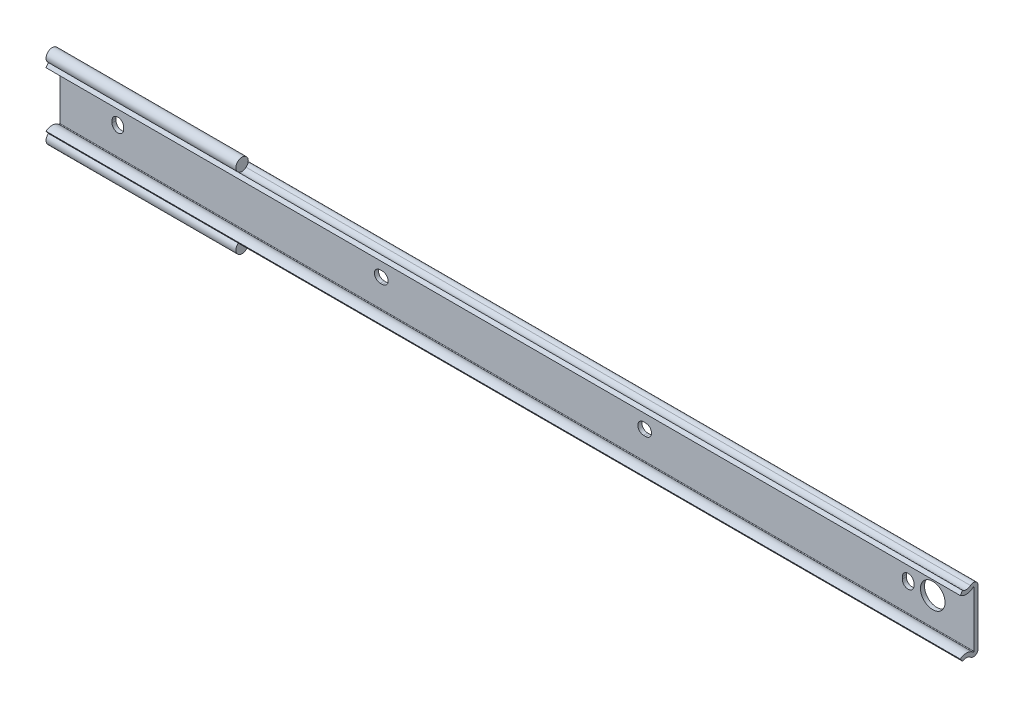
ISO-10303-21;
HEADER;
FILE_DESCRIPTION(('STEP AP214'),'2;1');
FILE_NAME('part.step','',(''),(''),'','','');
FILE_SCHEMA(('AUTOMOTIVE_DESIGN { 1 0 10303 214 1 1 1 1 }'));
ENDSEC;
DATA;
#1=APPLICATION_CONTEXT('core data for automotive mechanical design processes');
#2=APPLICATION_PROTOCOL_DEFINITION('international standard','automotive_design',2000,#1);
#3=PRODUCT_CONTEXT('',#1,'mechanical');
#4=PRODUCT('Part','Part','',(#3));
#5=PRODUCT_RELATED_PRODUCT_CATEGORY('part','',(#4));
#6=PRODUCT_DEFINITION_FORMATION('','',#4);
#7=PRODUCT_DEFINITION_CONTEXT('part definition',#1,'design');
#8=PRODUCT_DEFINITION('design','',#6,#7);
#9=PRODUCT_DEFINITION_SHAPE('','',#8);
#10=(LENGTH_UNIT() NAMED_UNIT(*) SI_UNIT(.MILLI.,.METRE.));
#11=(NAMED_UNIT(*) PLANE_ANGLE_UNIT() SI_UNIT($,.RADIAN.));
#12=(NAMED_UNIT(*) SI_UNIT($,.STERADIAN.) SOLID_ANGLE_UNIT());
#13=UNCERTAINTY_MEASURE_WITH_UNIT(LENGTH_MEASURE(1.E-05),#10,'distance_accuracy_value','');
#14=(GEOMETRIC_REPRESENTATION_CONTEXT(3) GLOBAL_UNCERTAINTY_ASSIGNED_CONTEXT((#13)) GLOBAL_UNIT_ASSIGNED_CONTEXT((#10,
#11,#12)) REPRESENTATION_CONTEXT('',''));
#15=CARTESIAN_POINT('',(0.,0.,0.));
#16=DIRECTION('',(0.,0.,1.));
#17=DIRECTION('',(1.,0.,0.));
#18=AXIS2_PLACEMENT_3D('',#15,#16,#17);
#19=CARTESIAN_POINT('',(330.2,10.6847650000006,1.74000019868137));
#20=DIRECTION('',(-1.,0.,0.));
#21=DIRECTION('',(0.,0.,1.));
#22=AXIS2_PLACEMENT_3D('',#19,#20,#21);
#23=CYLINDRICAL_SURFACE('',#22,1.7400001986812);
#24=CARTESIAN_POINT('',(-22.4,10.6847650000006,1.74000019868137));
#25=DIRECTION('',(1.,0.,0.));
#26=DIRECTION('',(0.,0.,-1.));
#27=AXIS2_PLACEMENT_3D('',#24,#25,#26);
#28=CIRCLE('',#27,1.7400001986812);
#29=CARTESIAN_POINT('',(-22.4,12.421670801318,1.84372545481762));
#30=VERTEX_POINT('',#29);
#31=CARTESIAN_POINT('',(-22.4,12.1726708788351,2.64207380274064));
#32=VERTEX_POINT('',#31);
#33=EDGE_CURVE('E251',#30,#32,#28,.T.);
#34=ORIENTED_EDGE('',*,*,#33,.T.);
#35=DIRECTION('',(-1.,0.,0.));
#36=VECTOR('',#35,1.);
#37=CARTESIAN_POINT('',(14.2,12.1726708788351,2.64207380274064));
#38=LINE('',#37,#36);
#39=CARTESIAN_POINT('',(50.8,12.1726708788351,2.64207380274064));
#40=VERTEX_POINT('',#39);
#41=EDGE_CURVE('E468',#32,#40,#38,.F.);
#42=ORIENTED_EDGE('',*,*,#41,.T.);
#43=CARTESIAN_POINT('',(50.8,10.6847650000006,1.74000019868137));
#44=DIRECTION('',(-1.,0.,0.));
#45=DIRECTION('',(0.,0.,1.));
#46=AXIS2_PLACEMENT_3D('',#43,#44,#45);
#47=CIRCLE('',#46,1.7400001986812);
#48=CARTESIAN_POINT('',(50.8,11.9768810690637,2.90534853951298));
#49=VERTEX_POINT('',#48);
#50=EDGE_CURVE('E464',#49,#40,#47,.T.);
#51=ORIENTED_EDGE('',*,*,#50,.F.);
#52=DIRECTION('',(-1.,0.,0.));
#53=VECTOR('',#52,1.);
#54=CARTESIAN_POINT('',(330.2,11.9768810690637,2.90534853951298));
#55=LINE('',#54,#53);
#56=CARTESIAN_POINT('',(330.2,11.9768810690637,2.90534853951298));
#57=VERTEX_POINT('',#56);
#58=EDGE_CURVE('E341',#57,#49,#55,.T.);
#59=ORIENTED_EDGE('',*,*,#58,.F.);
#60=CARTESIAN_POINT('',(330.2,10.6847650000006,1.74000019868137));
#61=DIRECTION('',(1.,0.,0.));
#62=DIRECTION('',(0.,0.,-1.));
#63=AXIS2_PLACEMENT_3D('',#60,#61,#62);
#64=CIRCLE('',#63,1.7400001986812);
#65=CARTESIAN_POINT('',(330.2,12.421670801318,1.84372545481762));
#66=VERTEX_POINT('',#65);
#67=EDGE_CURVE('E248',#66,#57,#64,.T.);
#68=ORIENTED_EDGE('',*,*,#67,.F.);
#69=CARTESIAN_POINT('',(330.2,10.6847650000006,1.74000019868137));
#70=DIRECTION('',(-1.,0.,0.));
#71=DIRECTION('',(0.,0.998221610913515,0.0596122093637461));
#72=AXIS2_PLACEMENT_3D('',#69,#70,#71);
#73=CIRCLE('',#72,1.7400001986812);
#74=CARTESIAN_POINT('',(330.2,12.421670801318,1.63627494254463));
#75=VERTEX_POINT('',#74);
#76=EDGE_CURVE('E239',#66,#75,#73,.T.);
#77=ORIENTED_EDGE('',*,*,#76,.T.);
#78=CARTESIAN_POINT('',(330.2,10.6847650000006,0.));
#79=VERTEX_POINT('',#78);
#80=EDGE_CURVE('E236',#79,#75,#64,.T.);
#81=ORIENTED_EDGE('',*,*,#80,.F.);
#82=DIRECTION('',(-1.,0.,0.));
#83=VECTOR('',#82,1.);
#84=CARTESIAN_POINT('',(330.2,10.6847650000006,0.));
#85=LINE('',#84,#83);
#86=CARTESIAN_POINT('',(-22.4,10.6847650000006,0.));
#87=VERTEX_POINT('',#86);
#88=EDGE_CURVE('E373',#79,#87,#85,.T.);
#89=ORIENTED_EDGE('',*,*,#88,.T.);
#90=CARTESIAN_POINT('',(-22.4,12.421670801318,1.63627494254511));
#91=VERTEX_POINT('',#90);
#92=EDGE_CURVE('E268',#87,#91,#28,.T.);
#93=ORIENTED_EDGE('',*,*,#92,.T.);
#94=CARTESIAN_POINT('',(-22.4,10.6847650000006,1.74000019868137));
#95=DIRECTION('',(1.,0.,0.));
#96=DIRECTION('',(0.,0.998221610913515,-0.0596122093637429));
#97=AXIS2_PLACEMENT_3D('',#94,#95,#96);
#98=CIRCLE('',#97,1.7400001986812);
#99=EDGE_CURVE('E265',#91,#30,#98,.T.);
#100=ORIENTED_EDGE('',*,*,#99,.T.);
#101=EDGE_LOOP('',(#34,#42,#51,#59,#68,#77,#81,#89,#93,#100));
#102=FACE_BOUND('',#101,.T.);
#103=ADVANCED_FACE('F14',(#102),#23,.T.);
#104=CARTESIAN_POINT('',(330.2,10.6847650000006,1.74000019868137));
#105=DIRECTION('',(1.,0.,0.));
#106=DIRECTION('',(0.,0.,-1.));
#107=AXIS2_PLACEMENT_3D('',#104,#105,#106);
#108=PLANE('',#107);
#109=DIRECTION('',(0.,1.,0.));
#110=VECTOR('',#109,1.);
#111=CARTESIAN_POINT('',(330.2,-10.6847650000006,0.));
#112=LINE('',#111,#110);
#113=CARTESIAN_POINT('',(330.2,-10.6847650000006,0.));
#114=VERTEX_POINT('',#113);
#115=EDGE_CURVE('E243',#114,#79,#112,.T.);
#116=ORIENTED_EDGE('',*,*,#115,.T.);
#117=ORIENTED_EDGE('',*,*,#80,.T.);
#118=ORIENTED_EDGE('',*,*,#76,.F.);
#119=ORIENTED_EDGE('',*,*,#67,.T.);
#120=CARTESIAN_POINT('',(330.2,13.7450000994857,4.50000028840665));
#121=DIRECTION('',(-1.,0.,0.));
#122=DIRECTION('',(0.,0.,-1.));
#123=AXIS2_PLACEMENT_3D('',#120,#121,#122);
#124=CIRCLE('',#123,2.38099960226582);
#125=CARTESIAN_POINT('',(330.2,11.8434490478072,5.93292132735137));
#126=VERTEX_POINT('',#125);
#127=EDGE_CURVE('E247',#57,#126,#124,.T.);
#128=ORIENTED_EDGE('',*,*,#127,.T.);
#129=DIRECTION('',(0.,-0.798635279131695,0.601815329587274));
#130=VECTOR('',#129,1.);
#131=CARTESIAN_POINT('',(330.2,10.6055642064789,6.86573520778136));
#132=LINE('',#131,#130);
#133=CARTESIAN_POINT('',(330.2,10.6055642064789,6.86573520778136));
#134=VERTEX_POINT('',#133);
#135=EDGE_CURVE('E391',#126,#134,#132,.T.);
#136=ORIENTED_EDGE('',*,*,#135,.T.);
#137=CARTESIAN_POINT('',(330.2,13.7450000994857,4.50000028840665));
#138=DIRECTION('',(1.,0.,0.));
#139=DIRECTION('',(0.,0.,-1.));
#140=AXIS2_PLACEMENT_3D('',#137,#138,#139);
#141=CIRCLE('',#140,3.9309998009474);
#142=CARTESIAN_POINT('',(330.2,10.8258581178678,1.86725086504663));
#143=VERTEX_POINT('',#142);
#144=EDGE_CURVE('E390',#134,#143,#141,.T.);
#145=ORIENTED_EDGE('',*,*,#144,.T.);
#146=CARTESIAN_POINT('',(330.2,10.6847650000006,1.74000019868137));
#147=DIRECTION('',(-1.,0.,0.));
#148=DIRECTION('',(0.,0.,-1.));
#149=AXIS2_PLACEMENT_3D('',#146,#147,#148);
#150=CIRCLE('',#149,0.18999999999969);
#151=CARTESIAN_POINT('',(330.2,10.6847650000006,1.55000019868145));
#152=VERTEX_POINT('',#151);
#153=EDGE_CURVE('E388',#143,#152,#150,.T.);
#154=ORIENTED_EDGE('',*,*,#153,.T.);
#155=DIRECTION('',(0.,-1.,0.));
#156=VECTOR('',#155,1.);
#157=CARTESIAN_POINT('',(330.2,-10.6847650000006,1.55000019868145));
#158=LINE('',#157,#156);
#159=CARTESIAN_POINT('',(330.2,-10.6847650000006,1.55000019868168));
#160=VERTEX_POINT('',#159);
#161=EDGE_CURVE('E386',#152,#160,#158,.T.);
#162=ORIENTED_EDGE('',*,*,#161,.T.);
#163=CARTESIAN_POINT('',(330.2,-10.6847650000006,1.74000019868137));
#164=DIRECTION('',(-1.,0.,0.));
#165=DIRECTION('',(0.,0.,1.));
#166=AXIS2_PLACEMENT_3D('',#163,#164,#165);
#167=CIRCLE('',#166,0.18999999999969);
#168=CARTESIAN_POINT('',(330.2,-10.8258581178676,1.86725086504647));
#169=VERTEX_POINT('',#168);
#170=EDGE_CURVE('E384',#160,#169,#167,.T.);
#171=ORIENTED_EDGE('',*,*,#170,.T.);
#172=CARTESIAN_POINT('',(330.2,-13.7450000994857,4.50000028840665));
#173=DIRECTION('',(1.,0.,0.));
#174=DIRECTION('',(0.,0.,1.));
#175=AXIS2_PLACEMENT_3D('',#172,#173,#174);
#176=CIRCLE('',#175,3.9309998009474);
#177=CARTESIAN_POINT('',(330.2,-10.6055642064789,6.86573520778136));
#178=VERTEX_POINT('',#177);
#179=EDGE_CURVE('E382',#169,#178,#176,.T.);
#180=ORIENTED_EDGE('',*,*,#179,.T.);
#181=DIRECTION('',(0.,-0.798635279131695,-0.601815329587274));
#182=VECTOR('',#181,1.);
#183=CARTESIAN_POINT('',(330.2,-10.6055642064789,6.86573520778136));
#184=LINE('',#183,#182);
#185=CARTESIAN_POINT('',(330.2,-11.8434490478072,5.93292132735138));
#186=VERTEX_POINT('',#185);
#187=EDGE_CURVE('E380',#178,#186,#184,.T.);
#188=ORIENTED_EDGE('',*,*,#187,.T.);
#189=CARTESIAN_POINT('',(330.2,-13.7450000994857,4.50000028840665));
#190=DIRECTION('',(-1.,0.,0.));
#191=DIRECTION('',(0.,0.,1.));
#192=AXIS2_PLACEMENT_3D('',#189,#190,#191);
#193=CIRCLE('',#192,2.38099960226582);
#194=CARTESIAN_POINT('',(330.2,-11.9768810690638,2.90534853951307));
#195=VERTEX_POINT('',#194);
#196=EDGE_CURVE('E378',#186,#195,#193,.T.);
#197=ORIENTED_EDGE('',*,*,#196,.T.);
#198=CARTESIAN_POINT('',(330.2,-10.6847650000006,1.74000019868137));
#199=DIRECTION('',(1.,0.,0.));
#200=DIRECTION('',(0.,0.,1.));
#201=AXIS2_PLACEMENT_3D('',#198,#199,#200);
#202=CIRCLE('',#201,1.7400001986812);
#203=EDGE_CURVE('E376',#195,#114,#202,.T.);
#204=ORIENTED_EDGE('',*,*,#203,.T.);
#205=EDGE_LOOP('',(#116,#117,#118,#119,#128,#136,#145,#154,#162,#171,#180,#188,#197,#204));
#206=FACE_BOUND('',#205,.T.);
#207=ADVANCED_FACE('F238',(#206),#108,.T.);
#208=CARTESIAN_POINT('',(-22.4,10.6847650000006,1.74000019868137));
#209=DIRECTION('',(1.,0.,0.));
#210=DIRECTION('',(0.,0.,-1.));
#211=AXIS2_PLACEMENT_3D('',#208,#209,#210);
#212=PLANE('',#211);
#213=CARTESIAN_POINT('',(-22.4,13.745,4.45));
#214=DIRECTION('',(-1.,0.,0.));
#215=DIRECTION('',(0.,0.,1.));
#216=AXIS2_PLACEMENT_3D('',#213,#214,#215);
#217=CIRCLE('',#216,2.396);
#218=CARTESIAN_POINT('',(-22.4,11.4666473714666,5.19156948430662));
#219=VERTEX_POINT('',#218);
#220=EDGE_CURVE('E460',#219,#32,#217,.T.);
#221=ORIENTED_EDGE('',*,*,#220,.T.);
#222=ORIENTED_EDGE('',*,*,#33,.F.);
#223=ORIENTED_EDGE('',*,*,#99,.F.);
#224=ORIENTED_EDGE('',*,*,#92,.F.);
#225=DIRECTION('',(0.,1.,0.));
#226=VECTOR('',#225,1.);
#227=CARTESIAN_POINT('',(-22.4,-10.6847650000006,0.));
#228=LINE('',#227,#226);
#229=CARTESIAN_POINT('',(-22.4,-10.6847650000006,0.));
#230=VERTEX_POINT('',#229);
#231=EDGE_CURVE('E294',#230,#87,#228,.T.);
#232=ORIENTED_EDGE('',*,*,#231,.F.);
#233=CARTESIAN_POINT('',(-22.4,-10.6847650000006,1.74000019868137));
#234=DIRECTION('',(1.,0.,0.));
#235=DIRECTION('',(0.,0.,1.));
#236=AXIS2_PLACEMENT_3D('',#233,#234,#235);
#237=CIRCLE('',#236,1.7400001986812);
#238=CARTESIAN_POINT('',(-22.4,-12.1726708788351,2.64207380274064));
#239=VERTEX_POINT('',#238);
#240=EDGE_CURVE('E292',#239,#230,#237,.T.);
#241=ORIENTED_EDGE('',*,*,#240,.F.);
#242=CARTESIAN_POINT('',(-22.4,-13.745,4.45));
#243=DIRECTION('',(-1.,0.,0.));
#244=DIRECTION('',(0.,0.,-1.));
#245=AXIS2_PLACEMENT_3D('',#242,#243,#244);
#246=CIRCLE('',#245,2.396);
#247=CARTESIAN_POINT('',(-22.4,-11.4666473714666,5.19156948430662));
#248=VERTEX_POINT('',#247);
#249=EDGE_CURVE('E442',#239,#248,#246,.T.);
#250=ORIENTED_EDGE('',*,*,#249,.T.);
#251=CARTESIAN_POINT('',(-22.4,-13.7450000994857,4.50000028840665));
#252=DIRECTION('',(-1.,0.,0.));
#253=DIRECTION('',(0.,0.,1.));
#254=AXIS2_PLACEMENT_3D('',#251,#252,#253);
#255=CIRCLE('',#254,2.38099960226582);
#256=CARTESIAN_POINT('',(-22.4,-11.8434490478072,5.93292132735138));
#257=VERTEX_POINT('',#256);
#258=EDGE_CURVE('E37',#257,#248,#255,.T.);
#259=ORIENTED_EDGE('',*,*,#258,.F.);
#260=DIRECTION('',(0.,-0.798635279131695,-0.601815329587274));
#261=VECTOR('',#260,1.);
#262=CARTESIAN_POINT('',(-22.4,-10.6055642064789,6.86573520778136));
#263=LINE('',#262,#261);
#264=CARTESIAN_POINT('',(-22.4,-10.6055642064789,6.86573520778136));
#265=VERTEX_POINT('',#264);
#266=EDGE_CURVE('E289',#265,#257,#263,.T.);
#267=ORIENTED_EDGE('',*,*,#266,.F.);
#268=CARTESIAN_POINT('',(-22.4,-13.7450000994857,4.50000028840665));
#269=DIRECTION('',(1.,0.,0.));
#270=DIRECTION('',(0.,0.,1.));
#271=AXIS2_PLACEMENT_3D('',#268,#269,#270);
#272=CIRCLE('',#271,3.9309998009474);
#273=CARTESIAN_POINT('',(-22.4,-10.8258581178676,1.86725086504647));
#274=VERTEX_POINT('',#273);
#275=EDGE_CURVE('E287',#274,#265,#272,.T.);
#276=ORIENTED_EDGE('',*,*,#275,.F.);
#277=CARTESIAN_POINT('',(-22.4,-10.6847650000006,1.74000019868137));
#278=DIRECTION('',(-1.,0.,0.));
#279=DIRECTION('',(0.,0.,1.));
#280=AXIS2_PLACEMENT_3D('',#277,#278,#279);
#281=CIRCLE('',#280,0.18999999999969);
#282=CARTESIAN_POINT('',(-22.4,-10.6847650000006,1.55000019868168));
#283=VERTEX_POINT('',#282);
#284=EDGE_CURVE('E285',#283,#274,#281,.T.);
#285=ORIENTED_EDGE('',*,*,#284,.F.);
#286=DIRECTION('',(0.,-1.,0.));
#287=VECTOR('',#286,1.);
#288=CARTESIAN_POINT('',(-22.4,-10.6847650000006,1.55000019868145));
#289=LINE('',#288,#287);
#290=CARTESIAN_POINT('',(-22.4,10.6847650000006,1.55000019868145));
#291=VERTEX_POINT('',#290);
#292=EDGE_CURVE('E283',#291,#283,#289,.T.);
#293=ORIENTED_EDGE('',*,*,#292,.F.);
#294=CARTESIAN_POINT('',(-22.4,10.6847650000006,1.74000019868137));
#295=DIRECTION('',(-1.,0.,0.));
#296=DIRECTION('',(0.,0.,-1.));
#297=AXIS2_PLACEMENT_3D('',#294,#295,#296);
#298=CIRCLE('',#297,0.18999999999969);
#299=CARTESIAN_POINT('',(-22.4,10.8258581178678,1.86725086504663));
#300=VERTEX_POINT('',#299);
#301=EDGE_CURVE('E281',#300,#291,#298,.T.);
#302=ORIENTED_EDGE('',*,*,#301,.F.);
#303=CARTESIAN_POINT('',(-22.4,13.7450000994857,4.50000028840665));
#304=DIRECTION('',(1.,0.,0.));
#305=DIRECTION('',(0.,0.,-1.));
#306=AXIS2_PLACEMENT_3D('',#303,#304,#305);
#307=CIRCLE('',#306,3.9309998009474);
#308=CARTESIAN_POINT('',(-22.4,10.6055642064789,6.86573520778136));
#309=VERTEX_POINT('',#308);
#310=EDGE_CURVE('E279',#309,#300,#307,.T.);
#311=ORIENTED_EDGE('',*,*,#310,.F.);
#312=DIRECTION('',(0.,-0.798635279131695,0.601815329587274));
#313=VECTOR('',#312,1.);
#314=CARTESIAN_POINT('',(-22.4,10.6055642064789,6.86573520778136));
#315=LINE('',#314,#313);
#316=CARTESIAN_POINT('',(-22.4,11.8434490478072,5.93292132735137));
#317=VERTEX_POINT('',#316);
#318=EDGE_CURVE('E277',#317,#309,#315,.T.);
#319=ORIENTED_EDGE('',*,*,#318,.F.);
#320=CARTESIAN_POINT('',(-22.4,13.7450000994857,4.50000028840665));
#321=DIRECTION('',(-1.,0.,0.));
#322=DIRECTION('',(0.,0.,-1.));
#323=AXIS2_PLACEMENT_3D('',#320,#321,#322);
#324=CIRCLE('',#323,2.38099960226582);
#325=EDGE_CURVE('E274',#219,#317,#324,.T.);
#326=ORIENTED_EDGE('',*,*,#325,.F.);
#327=EDGE_LOOP('',(#221,#222,#223,#224,#232,#241,#250,#259,#267,#276,#285,#293,#302,#311,#319,#326));
#328=FACE_BOUND('',#327,.T.);
#329=ADVANCED_FACE('F308',(#328),#212,.F.);
#330=CARTESIAN_POINT('',(330.2,13.7450000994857,4.50000028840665));
#331=DIRECTION('',(-1.,0.,0.));
#332=DIRECTION('',(0.,0.,1.));
#333=AXIS2_PLACEMENT_3D('',#330,#331,#332);
#334=CYLINDRICAL_SURFACE('',#333,2.38099960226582);
#335=CARTESIAN_POINT('',(50.8,13.7450000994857,4.50000028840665));
#336=DIRECTION('',(-1.,0.,0.));
#337=DIRECTION('',(0.,0.,1.));
#338=AXIS2_PLACEMENT_3D('',#335,#336,#337);
#339=CIRCLE('',#338,2.38099960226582);
#340=CARTESIAN_POINT('',(50.8,11.4666473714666,5.19156948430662));
#341=VERTEX_POINT('',#340);
#342=EDGE_CURVE('E338',#341,#49,#339,.F.);
#343=ORIENTED_EDGE('',*,*,#342,.F.);
#344=DIRECTION('',(-1.,0.,0.));
#345=VECTOR('',#344,1.);
#346=CARTESIAN_POINT('',(14.2,11.4666473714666,5.19156948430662));
#347=LINE('',#346,#345);
#348=EDGE_CURVE('E335',#341,#219,#347,.T.);
#349=ORIENTED_EDGE('',*,*,#348,.T.);
#350=ORIENTED_EDGE('',*,*,#325,.T.);
#351=DIRECTION('',(-1.,0.,0.));
#352=VECTOR('',#351,1.);
#353=CARTESIAN_POINT('',(330.2,11.8434490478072,5.93292132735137));
#354=LINE('',#353,#352);
#355=EDGE_CURVE('E344',#126,#317,#354,.T.);
#356=ORIENTED_EDGE('',*,*,#355,.F.);
#357=ORIENTED_EDGE('',*,*,#127,.F.);
#358=ORIENTED_EDGE('',*,*,#58,.T.);
#359=EDGE_LOOP('',(#343,#349,#350,#356,#357,#358));
#360=FACE_BOUND('',#359,.T.);
#361=ADVANCED_FACE('F318',(#360),#334,.F.);
#362=CARTESIAN_POINT('',(330.2,10.6055642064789,6.86573520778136));
#363=DIRECTION('',(0.,-0.601815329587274,-0.798635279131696));
#364=DIRECTION('',(0.,0.798635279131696,-0.601815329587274));
#365=AXIS2_PLACEMENT_3D('',#362,#363,#364);
#366=PLANE('',#365);
#367=ORIENTED_EDGE('',*,*,#318,.T.);
#368=DIRECTION('',(-1.,0.,0.));
#369=VECTOR('',#368,1.);
#370=CARTESIAN_POINT('',(330.2,10.6055642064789,6.86573520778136));
#371=LINE('',#370,#369);
#372=EDGE_CURVE('E347',#134,#309,#371,.T.);
#373=ORIENTED_EDGE('',*,*,#372,.F.);
#374=ORIENTED_EDGE('',*,*,#135,.F.);
#375=ORIENTED_EDGE('',*,*,#355,.T.);
#376=EDGE_LOOP('',(#367,#373,#374,#375));
#377=FACE_BOUND('',#376,.T.);
#378=ADVANCED_FACE('F399',(#377),#366,.F.);
#379=CARTESIAN_POINT('',(330.2,13.7450000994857,4.50000028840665));
#380=DIRECTION('',(-1.,0.,0.));
#381=DIRECTION('',(0.,0.,1.));
#382=AXIS2_PLACEMENT_3D('',#379,#380,#381);
#383=CYLINDRICAL_SURFACE('',#382,3.9309998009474);
#384=ORIENTED_EDGE('',*,*,#310,.T.);
#385=DIRECTION('',(-1.,0.,0.));
#386=VECTOR('',#385,1.);
#387=CARTESIAN_POINT('',(330.2,10.8258581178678,1.86725086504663));
#388=LINE('',#387,#386);
#389=EDGE_CURVE('E350',#143,#300,#388,.T.);
#390=ORIENTED_EDGE('',*,*,#389,.F.);
#391=ORIENTED_EDGE('',*,*,#144,.F.);
#392=ORIENTED_EDGE('',*,*,#372,.T.);
#393=EDGE_LOOP('',(#384,#390,#391,#392));
#394=FACE_BOUND('',#393,.T.);
#395=ADVANCED_FACE('F404',(#394),#383,.T.);
#396=CARTESIAN_POINT('',(330.2,10.6847650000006,1.74000019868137));
#397=DIRECTION('',(-1.,0.,0.));
#398=DIRECTION('',(0.,0.,1.));
#399=AXIS2_PLACEMENT_3D('',#396,#397,#398);
#400=CYLINDRICAL_SURFACE('',#399,0.18999999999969);
#401=ORIENTED_EDGE('',*,*,#301,.T.);
#402=DIRECTION('',(-1.,0.,0.));
#403=VECTOR('',#402,1.);
#404=CARTESIAN_POINT('',(330.2,10.6847650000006,1.55000019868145));
#405=LINE('',#404,#403);
#406=EDGE_CURVE('E353',#152,#291,#405,.T.);
#407=ORIENTED_EDGE('',*,*,#406,.F.);
#408=ORIENTED_EDGE('',*,*,#153,.F.);
#409=ORIENTED_EDGE('',*,*,#389,.T.);
#410=EDGE_LOOP('',(#401,#407,#408,#409));
#411=FACE_BOUND('',#410,.T.);
#412=ADVANCED_FACE('F410',(#411),#400,.F.);
#413=CARTESIAN_POINT('',(330.2,-10.6847650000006,1.55000019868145));
#414=DIRECTION('',(0.,0.,-1.));
#415=DIRECTION('',(-1.,0.,0.));
#416=AXIS2_PLACEMENT_3D('',#413,#414,#415);
#417=PLANE('',#416);
#418=CARTESIAN_POINT('',(314.3,0.,1.55000019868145));
#419=DIRECTION('',(0.,0.,-1.));
#420=DIRECTION('',(-1.,0.,0.));
#421=AXIS2_PLACEMENT_3D('',#418,#419,#420);
#422=CIRCLE('',#421,4.75);
#423=CARTESIAN_POINT('',(309.55,0.,1.55000019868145));
#424=VERTEX_POINT('',#423);
#425=EDGE_CURVE('E450',#424,#424,#422,.T.);
#426=ORIENTED_EDGE('',*,*,#425,.T.);
#427=EDGE_LOOP('',(#426));
#428=FACE_BOUND('',#427,.T.);
#429=DIRECTION('',(0.,-1.,0.));
#430=VECTOR('',#429,1.);
#431=CARTESIAN_POINT('',(-2.25,0.4,1.55000019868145));
#432=LINE('',#431,#430);
#433=CARTESIAN_POINT('',(-2.25,0.4,1.55000019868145));
#434=VERTEX_POINT('',#433);
#435=CARTESIAN_POINT('',(-2.25,-0.4,1.55000019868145));
#436=VERTEX_POINT('',#435);
#437=EDGE_CURVE('E472',#434,#436,#432,.T.);
#438=ORIENTED_EDGE('',*,*,#437,.F.);
#439=CARTESIAN_POINT('',(0.,0.4,1.55000019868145));
#440=DIRECTION('',(0.,0.,-1.));
#441=DIRECTION('',(-1.,0.,0.));
#442=AXIS2_PLACEMENT_3D('',#439,#440,#441);
#443=CIRCLE('',#442,2.24999999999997);
#444=CARTESIAN_POINT('',(2.25,0.4,1.55000019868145));
#445=VERTEX_POINT('',#444);
#446=EDGE_CURVE('E475',#445,#434,#443,.F.);
#447=ORIENTED_EDGE('',*,*,#446,.F.);
#448=DIRECTION('',(0.,1.,0.));
#449=VECTOR('',#448,1.);
#450=CARTESIAN_POINT('',(2.25,-0.4,1.55000019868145));
#451=LINE('',#450,#449);
#452=CARTESIAN_POINT('',(2.25,-0.4,1.55000019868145));
#453=VERTEX_POINT('',#452);
#454=EDGE_CURVE('E492',#453,#445,#451,.T.);
#455=ORIENTED_EDGE('',*,*,#454,.F.);
#456=CARTESIAN_POINT('',(0.,-0.4,1.55000019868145));
#457=DIRECTION('',(0.,0.,-1.));
#458=DIRECTION('',(-1.,0.,0.));
#459=AXIS2_PLACEMENT_3D('',#456,#457,#458);
#460=CIRCLE('',#459,2.24999999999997);
#461=EDGE_CURVE('E470',#436,#453,#460,.F.);
#462=ORIENTED_EDGE('',*,*,#461,.F.);
#463=EDGE_LOOP('',(#438,#447,#455,#462));
#464=FACE_BOUND('',#463,.T.);
#465=DIRECTION('',(-1.,0.,0.));
#466=VECTOR('',#465,1.);
#467=CARTESIAN_POINT('',(203.600000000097,2.25,1.55000019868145));
#468=LINE('',#467,#466);
#469=CARTESIAN_POINT('',(203.600000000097,2.25,1.55000019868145));
#470=VERTEX_POINT('',#469);
#471=CARTESIAN_POINT('',(202.800000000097,2.25,1.55000019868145));
#472=VERTEX_POINT('',#471);
#473=EDGE_CURVE('E503',#470,#472,#468,.T.);
#474=ORIENTED_EDGE('',*,*,#473,.F.);
#475=CARTESIAN_POINT('',(203.600000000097,0.,1.55000019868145));
#476=DIRECTION('',(0.,0.,-1.));
#477=DIRECTION('',(-1.,0.,0.));
#478=AXIS2_PLACEMENT_3D('',#475,#476,#477);
#479=CIRCLE('',#478,2.25);
#480=CARTESIAN_POINT('',(203.600000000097,-2.25,1.55000019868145));
#481=VERTEX_POINT('',#480);
#482=EDGE_CURVE('E506',#481,#470,#479,.F.);
#483=ORIENTED_EDGE('',*,*,#482,.F.);
#484=DIRECTION('',(1.,0.,0.));
#485=VECTOR('',#484,1.);
#486=CARTESIAN_POINT('',(202.800000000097,-2.25,1.55000019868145));
#487=LINE('',#486,#485);
#488=CARTESIAN_POINT('',(202.800000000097,-2.25,1.55000019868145));
#489=VERTEX_POINT('',#488);
#490=EDGE_CURVE('E523',#489,#481,#487,.T.);
#491=ORIENTED_EDGE('',*,*,#490,.F.);
#492=CARTESIAN_POINT('',(202.800000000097,0.,1.55000019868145));
#493=DIRECTION('',(0.,0.,-1.));
#494=DIRECTION('',(-1.,0.,0.));
#495=AXIS2_PLACEMENT_3D('',#492,#493,#494);
#496=CIRCLE('',#495,2.25);
#497=EDGE_CURVE('E501',#472,#489,#496,.F.);
#498=ORIENTED_EDGE('',*,*,#497,.F.);
#499=EDGE_LOOP('',(#474,#483,#491,#498));
#500=FACE_BOUND('',#499,.T.);
#501=DIRECTION('',(0.,-1.,0.));
#502=VECTOR('',#501,1.);
#503=CARTESIAN_POINT('',(302.55,0.4,1.55000019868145));
#504=LINE('',#503,#502);
#505=CARTESIAN_POINT('',(302.55,0.4,1.55000019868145));
#506=VERTEX_POINT('',#505);
#507=CARTESIAN_POINT('',(302.55,-0.4,1.55000019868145));
#508=VERTEX_POINT('',#507);
#509=EDGE_CURVE('E534',#506,#508,#504,.T.);
#510=ORIENTED_EDGE('',*,*,#509,.F.);
#511=CARTESIAN_POINT('',(304.8,0.4,1.55000019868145));
#512=DIRECTION('',(0.,0.,-1.));
#513=DIRECTION('',(-1.,0.,0.));
#514=AXIS2_PLACEMENT_3D('',#511,#512,#513);
#515=CIRCLE('',#514,2.24999999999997);
#516=CARTESIAN_POINT('',(307.05,0.4,1.55000019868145));
#517=VERTEX_POINT('',#516);
#518=EDGE_CURVE('E537',#517,#506,#515,.F.);
#519=ORIENTED_EDGE('',*,*,#518,.F.);
#520=DIRECTION('',(0.,1.,0.));
#521=VECTOR('',#520,1.);
#522=CARTESIAN_POINT('',(307.05,-0.4,1.55000019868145));
#523=LINE('',#522,#521);
#524=CARTESIAN_POINT('',(307.05,-0.4,1.55000019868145));
#525=VERTEX_POINT('',#524);
#526=EDGE_CURVE('E554',#525,#517,#523,.T.);
#527=ORIENTED_EDGE('',*,*,#526,.F.);
#528=CARTESIAN_POINT('',(304.8,-0.4,1.55000019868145));
#529=DIRECTION('',(0.,0.,-1.));
#530=DIRECTION('',(-1.,0.,0.));
#531=AXIS2_PLACEMENT_3D('',#528,#529,#530);
#532=CIRCLE('',#531,2.24999999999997);
#533=EDGE_CURVE('E532',#508,#525,#532,.F.);
#534=ORIENTED_EDGE('',*,*,#533,.F.);
#535=EDGE_LOOP('',(#510,#519,#527,#534));
#536=FACE_BOUND('',#535,.T.);
#537=DIRECTION('',(-1.,0.,0.));
#538=VECTOR('',#537,1.);
#539=CARTESIAN_POINT('',(101.999999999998,2.25,1.55000019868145));
#540=LINE('',#539,#538);
#541=CARTESIAN_POINT('',(101.999999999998,2.25,1.55000019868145));
#542=VERTEX_POINT('',#541);
#543=CARTESIAN_POINT('',(101.199999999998,2.25,1.55000019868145));
#544=VERTEX_POINT('',#543);
#545=EDGE_CURVE('E565',#542,#544,#540,.T.);
#546=ORIENTED_EDGE('',*,*,#545,.F.);
#547=CARTESIAN_POINT('',(101.999999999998,0.,1.55000019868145));
#548=DIRECTION('',(0.,0.,-1.));
#549=DIRECTION('',(-1.,0.,0.));
#550=AXIS2_PLACEMENT_3D('',#547,#548,#549);
#551=CIRCLE('',#550,2.25);
#552=CARTESIAN_POINT('',(101.999999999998,-2.25,1.55000019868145));
#553=VERTEX_POINT('',#552);
#554=EDGE_CURVE('E568',#553,#542,#551,.F.);
#555=ORIENTED_EDGE('',*,*,#554,.F.);
#556=DIRECTION('',(1.,0.,0.));
#557=VECTOR('',#556,1.);
#558=CARTESIAN_POINT('',(101.199999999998,-2.25,1.55000019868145));
#559=LINE('',#558,#557);
#560=CARTESIAN_POINT('',(101.199999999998,-2.25,1.55000019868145));
#561=VERTEX_POINT('',#560);
#562=EDGE_CURVE('E252',#561,#553,#559,.T.);
#563=ORIENTED_EDGE('',*,*,#562,.F.);
#564=CARTESIAN_POINT('',(101.199999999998,0.,1.55000019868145));
#565=DIRECTION('',(0.,0.,-1.));
#566=DIRECTION('',(-1.,0.,0.));
#567=AXIS2_PLACEMENT_3D('',#564,#565,#566);
#568=CIRCLE('',#567,2.25);
#569=EDGE_CURVE('E563',#544,#561,#568,.F.);
#570=ORIENTED_EDGE('',*,*,#569,.F.);
#571=EDGE_LOOP('',(#546,#555,#563,#570));
#572=FACE_BOUND('',#571,.T.);
#573=ORIENTED_EDGE('',*,*,#292,.T.);
#574=DIRECTION('',(-1.,0.,0.));
#575=VECTOR('',#574,1.);
#576=CARTESIAN_POINT('',(330.2,-10.6847650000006,1.55000019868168));
#577=LINE('',#576,#575);
#578=EDGE_CURVE('E356',#160,#283,#577,.T.);
#579=ORIENTED_EDGE('',*,*,#578,.F.);
#580=ORIENTED_EDGE('',*,*,#161,.F.);
#581=ORIENTED_EDGE('',*,*,#406,.T.);
#582=EDGE_LOOP('',(#573,#579,#580,#581));
#583=FACE_BOUND('',#582,.T.);
#584=ADVANCED_FACE('F414',(#428,#464,#500,#536,#572,#583),#417,.F.);
#585=CARTESIAN_POINT('',(330.2,-10.6847650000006,1.74000019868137));
#586=DIRECTION('',(-1.,0.,0.));
#587=DIRECTION('',(0.,0.,1.));
#588=AXIS2_PLACEMENT_3D('',#585,#586,#587);
#589=CYLINDRICAL_SURFACE('',#588,0.18999999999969);
#590=ORIENTED_EDGE('',*,*,#284,.T.);
#591=DIRECTION('',(-1.,0.,0.));
#592=VECTOR('',#591,1.);
#593=CARTESIAN_POINT('',(330.2,-10.8258581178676,1.86725086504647));
#594=LINE('',#593,#592);
#595=EDGE_CURVE('E359',#169,#274,#594,.T.);
#596=ORIENTED_EDGE('',*,*,#595,.F.);
#597=ORIENTED_EDGE('',*,*,#170,.F.);
#598=ORIENTED_EDGE('',*,*,#578,.T.);
#599=EDGE_LOOP('',(#590,#596,#597,#598));
#600=FACE_BOUND('',#599,.T.);
#601=ADVANCED_FACE('F419',(#600),#589,.F.);
#602=CARTESIAN_POINT('',(330.2,-13.7450000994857,4.50000028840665));
#603=DIRECTION('',(-1.,0.,0.));
#604=DIRECTION('',(0.,0.,1.));
#605=AXIS2_PLACEMENT_3D('',#602,#603,#604);
#606=CYLINDRICAL_SURFACE('',#605,3.9309998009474);
#607=ORIENTED_EDGE('',*,*,#275,.T.);
#608=DIRECTION('',(-1.,0.,0.));
#609=VECTOR('',#608,1.);
#610=CARTESIAN_POINT('',(330.2,-10.6055642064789,6.86573520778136));
#611=LINE('',#610,#609);
#612=EDGE_CURVE('E362',#178,#265,#611,.T.);
#613=ORIENTED_EDGE('',*,*,#612,.F.);
#614=ORIENTED_EDGE('',*,*,#179,.F.);
#615=ORIENTED_EDGE('',*,*,#595,.T.);
#616=EDGE_LOOP('',(#607,#613,#614,#615));
#617=FACE_BOUND('',#616,.T.);
#618=ADVANCED_FACE('F425',(#617),#606,.T.);
#619=CARTESIAN_POINT('',(330.2,-10.6055642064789,6.86573520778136));
#620=DIRECTION('',(0.,0.601815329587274,-0.798635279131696));
#621=DIRECTION('',(0.,0.798635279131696,0.601815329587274));
#622=AXIS2_PLACEMENT_3D('',#619,#620,#621);
#623=PLANE('',#622);
#624=ORIENTED_EDGE('',*,*,#266,.T.);
#625=DIRECTION('',(-1.,0.,0.));
#626=VECTOR('',#625,1.);
#627=CARTESIAN_POINT('',(330.2,-11.8434490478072,5.93292132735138));
#628=LINE('',#627,#626);
#629=EDGE_CURVE('E365',#186,#257,#628,.T.);
#630=ORIENTED_EDGE('',*,*,#629,.F.);
#631=ORIENTED_EDGE('',*,*,#187,.F.);
#632=ORIENTED_EDGE('',*,*,#612,.T.);
#633=EDGE_LOOP('',(#624,#630,#631,#632));
#634=FACE_BOUND('',#633,.T.);
#635=ADVANCED_FACE('F429',(#634),#623,.F.);
#636=CARTESIAN_POINT('',(330.2,-13.7450000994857,4.50000028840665));
#637=DIRECTION('',(-1.,0.,0.));
#638=DIRECTION('',(0.,0.,1.));
#639=AXIS2_PLACEMENT_3D('',#636,#637,#638);
#640=CYLINDRICAL_SURFACE('',#639,2.38099960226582);
#641=ORIENTED_EDGE('',*,*,#258,.T.);
#642=DIRECTION('',(-1.,0.,0.));
#643=VECTOR('',#642,1.);
#644=CARTESIAN_POINT('',(14.2,-11.4666473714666,5.19156948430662));
#645=LINE('',#644,#643);
#646=CARTESIAN_POINT('',(50.8,-11.4666473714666,5.19156948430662));
#647=VERTEX_POINT('',#646);
#648=EDGE_CURVE('E32',#248,#647,#645,.F.);
#649=ORIENTED_EDGE('',*,*,#648,.T.);
#650=CARTESIAN_POINT('',(50.8,-13.7450000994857,4.50000028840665));
#651=DIRECTION('',(1.,0.,0.));
#652=DIRECTION('',(0.,0.,-1.));
#653=AXIS2_PLACEMENT_3D('',#650,#651,#652);
#654=CIRCLE('',#653,2.38099960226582);
#655=CARTESIAN_POINT('',(50.8,-11.9768810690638,2.90534853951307));
#656=VERTEX_POINT('',#655);
#657=EDGE_CURVE('E452',#647,#656,#654,.F.);
#658=ORIENTED_EDGE('',*,*,#657,.T.);
#659=DIRECTION('',(-1.,0.,0.));
#660=VECTOR('',#659,1.);
#661=CARTESIAN_POINT('',(330.2,-11.9768810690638,2.90534853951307));
#662=LINE('',#661,#660);
#663=EDGE_CURVE('E367',#195,#656,#662,.T.);
#664=ORIENTED_EDGE('',*,*,#663,.F.);
#665=ORIENTED_EDGE('',*,*,#196,.F.);
#666=ORIENTED_EDGE('',*,*,#629,.T.);
#667=EDGE_LOOP('',(#641,#649,#658,#664,#665,#666));
#668=FACE_BOUND('',#667,.T.);
#669=ADVANCED_FACE('F432',(#668),#640,.F.);
#670=CARTESIAN_POINT('',(330.2,-10.6847650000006,1.74000019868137));
#671=DIRECTION('',(-1.,0.,0.));
#672=DIRECTION('',(0.,0.,1.));
#673=AXIS2_PLACEMENT_3D('',#670,#671,#672);
#674=CYLINDRICAL_SURFACE('',#673,1.7400001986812);
#675=CARTESIAN_POINT('',(50.8,-10.6847650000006,1.74000019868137));
#676=DIRECTION('',(1.,0.,0.));
#677=DIRECTION('',(0.,0.,-1.));
#678=AXIS2_PLACEMENT_3D('',#675,#676,#677);
#679=CIRCLE('',#678,1.7400001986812);
#680=CARTESIAN_POINT('',(50.8,-12.1726708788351,2.64207380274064));
#681=VERTEX_POINT('',#680);
#682=EDGE_CURVE('E24',#656,#681,#679,.T.);
#683=ORIENTED_EDGE('',*,*,#682,.T.);
#684=DIRECTION('',(-1.,0.,0.));
#685=VECTOR('',#684,1.);
#686=CARTESIAN_POINT('',(14.2,-12.1726708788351,2.64207380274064));
#687=LINE('',#686,#685);
#688=EDGE_CURVE('E9',#681,#239,#687,.T.);
#689=ORIENTED_EDGE('',*,*,#688,.T.);
#690=ORIENTED_EDGE('',*,*,#240,.T.);
#691=DIRECTION('',(-1.,0.,0.));
#692=VECTOR('',#691,1.);
#693=CARTESIAN_POINT('',(330.2,-10.6847650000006,0.));
#694=LINE('',#693,#692);
#695=EDGE_CURVE('E370',#114,#230,#694,.T.);
#696=ORIENTED_EDGE('',*,*,#695,.F.);
#697=ORIENTED_EDGE('',*,*,#203,.F.);
#698=ORIENTED_EDGE('',*,*,#663,.T.);
#699=EDGE_LOOP('',(#683,#689,#690,#696,#697,#698));
#700=FACE_BOUND('',#699,.T.);
#701=ADVANCED_FACE('F436',(#700),#674,.T.);
#702=CARTESIAN_POINT('',(330.2,-10.6847650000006,0.));
#703=DIRECTION('',(0.,0.,1.));
#704=DIRECTION('',(1.,0.,0.));
#705=AXIS2_PLACEMENT_3D('',#702,#703,#704);
#706=PLANE('',#705);
#707=CARTESIAN_POINT('',(314.3,0.,0.));
#708=DIRECTION('',(0.,0.,-1.));
#709=DIRECTION('',(-1.,0.,0.));
#710=AXIS2_PLACEMENT_3D('',#707,#708,#709);
#711=CIRCLE('',#710,4.75);
#712=CARTESIAN_POINT('',(309.55,0.,0.));
#713=VERTEX_POINT('',#712);
#714=EDGE_CURVE('E455',#713,#713,#711,.T.);
#715=ORIENTED_EDGE('',*,*,#714,.F.);
#716=EDGE_LOOP('',(#715));
#717=FACE_BOUND('',#716,.T.);
#718=DIRECTION('',(0.,-1.,0.));
#719=VECTOR('',#718,1.);
#720=CARTESIAN_POINT('',(2.25,-0.4,0.));
#721=LINE('',#720,#719);
#722=CARTESIAN_POINT('',(2.25,0.4,0.));
#723=VERTEX_POINT('',#722);
#724=CARTESIAN_POINT('',(2.25,-0.4,0.));
#725=VERTEX_POINT('',#724);
#726=EDGE_CURVE('E480',#723,#725,#721,.T.);
#727=ORIENTED_EDGE('',*,*,#726,.F.);
#728=CARTESIAN_POINT('',(0.,0.4,0.));
#729=DIRECTION('',(0.,0.,-1.));
#730=DIRECTION('',(-1.,0.,0.));
#731=AXIS2_PLACEMENT_3D('',#728,#729,#730);
#732=CIRCLE('',#731,2.24999999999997);
#733=CARTESIAN_POINT('',(-2.25,0.4,0.));
#734=VERTEX_POINT('',#733);
#735=EDGE_CURVE('E478',#734,#723,#732,.T.);
#736=ORIENTED_EDGE('',*,*,#735,.F.);
#737=DIRECTION('',(0.,1.,0.));
#738=VECTOR('',#737,1.);
#739=CARTESIAN_POINT('',(-2.25,0.4,0.));
#740=LINE('',#739,#738);
#741=CARTESIAN_POINT('',(-2.25,-0.4,0.));
#742=VERTEX_POINT('',#741);
#743=EDGE_CURVE('E486',#742,#734,#740,.T.);
#744=ORIENTED_EDGE('',*,*,#743,.F.);
#745=CARTESIAN_POINT('',(0.,-0.4,0.));
#746=DIRECTION('',(0.,0.,-1.));
#747=DIRECTION('',(-1.,0.,0.));
#748=AXIS2_PLACEMENT_3D('',#745,#746,#747);
#749=CIRCLE('',#748,2.24999999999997);
#750=EDGE_CURVE('E483',#725,#742,#749,.T.);
#751=ORIENTED_EDGE('',*,*,#750,.F.);
#752=EDGE_LOOP('',(#727,#736,#744,#751));
#753=FACE_BOUND('',#752,.T.);
#754=DIRECTION('',(-1.,0.,0.));
#755=VECTOR('',#754,1.);
#756=CARTESIAN_POINT('',(202.800000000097,-2.25,0.));
#757=LINE('',#756,#755);
#758=CARTESIAN_POINT('',(203.600000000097,-2.25,0.));
#759=VERTEX_POINT('',#758);
#760=CARTESIAN_POINT('',(202.800000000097,-2.25,0.));
#761=VERTEX_POINT('',#760);
#762=EDGE_CURVE('E511',#759,#761,#757,.T.);
#763=ORIENTED_EDGE('',*,*,#762,.F.);
#764=CARTESIAN_POINT('',(203.600000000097,0.,0.));
#765=DIRECTION('',(0.,0.,-1.));
#766=DIRECTION('',(-1.,0.,0.));
#767=AXIS2_PLACEMENT_3D('',#764,#765,#766);
#768=CIRCLE('',#767,2.25);
#769=CARTESIAN_POINT('',(203.600000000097,2.25,0.));
#770=VERTEX_POINT('',#769);
#771=EDGE_CURVE('E509',#770,#759,#768,.T.);
#772=ORIENTED_EDGE('',*,*,#771,.F.);
#773=DIRECTION('',(1.,0.,0.));
#774=VECTOR('',#773,1.);
#775=CARTESIAN_POINT('',(203.600000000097,2.25,0.));
#776=LINE('',#775,#774);
#777=CARTESIAN_POINT('',(202.800000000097,2.25,0.));
#778=VERTEX_POINT('',#777);
#779=EDGE_CURVE('E517',#778,#770,#776,.T.);
#780=ORIENTED_EDGE('',*,*,#779,.F.);
#781=CARTESIAN_POINT('',(202.800000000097,0.,0.));
#782=DIRECTION('',(0.,0.,-1.));
#783=DIRECTION('',(-1.,0.,0.));
#784=AXIS2_PLACEMENT_3D('',#781,#782,#783);
#785=CIRCLE('',#784,2.25);
#786=EDGE_CURVE('E514',#761,#778,#785,.T.);
#787=ORIENTED_EDGE('',*,*,#786,.F.);
#788=EDGE_LOOP('',(#763,#772,#780,#787));
#789=FACE_BOUND('',#788,.T.);
#790=DIRECTION('',(0.,-1.,0.));
#791=VECTOR('',#790,1.);
#792=CARTESIAN_POINT('',(307.05,-0.4,0.));
#793=LINE('',#792,#791);
#794=CARTESIAN_POINT('',(307.05,0.4,0.));
#795=VERTEX_POINT('',#794);
#796=CARTESIAN_POINT('',(307.05,-0.4,0.));
#797=VERTEX_POINT('',#796);
#798=EDGE_CURVE('E542',#795,#797,#793,.T.);
#799=ORIENTED_EDGE('',*,*,#798,.F.);
#800=CARTESIAN_POINT('',(304.8,0.4,0.));
#801=DIRECTION('',(0.,0.,-1.));
#802=DIRECTION('',(-1.,0.,0.));
#803=AXIS2_PLACEMENT_3D('',#800,#801,#802);
#804=CIRCLE('',#803,2.24999999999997);
#805=CARTESIAN_POINT('',(302.55,0.4,0.));
#806=VERTEX_POINT('',#805);
#807=EDGE_CURVE('E540',#806,#795,#804,.T.);
#808=ORIENTED_EDGE('',*,*,#807,.F.);
#809=DIRECTION('',(0.,1.,0.));
#810=VECTOR('',#809,1.);
#811=CARTESIAN_POINT('',(302.55,0.4,0.));
#812=LINE('',#811,#810);
#813=CARTESIAN_POINT('',(302.55,-0.4,0.));
#814=VERTEX_POINT('',#813);
#815=EDGE_CURVE('E548',#814,#806,#812,.T.);
#816=ORIENTED_EDGE('',*,*,#815,.F.);
#817=CARTESIAN_POINT('',(304.8,-0.4,0.));
#818=DIRECTION('',(0.,0.,-1.));
#819=DIRECTION('',(-1.,0.,0.));
#820=AXIS2_PLACEMENT_3D('',#817,#818,#819);
#821=CIRCLE('',#820,2.24999999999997);
#822=EDGE_CURVE('E545',#797,#814,#821,.T.);
#823=ORIENTED_EDGE('',*,*,#822,.F.);
#824=EDGE_LOOP('',(#799,#808,#816,#823));
#825=FACE_BOUND('',#824,.T.);
#826=DIRECTION('',(-1.,0.,0.));
#827=VECTOR('',#826,1.);
#828=CARTESIAN_POINT('',(101.199999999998,-2.25,0.));
#829=LINE('',#828,#827);
#830=CARTESIAN_POINT('',(101.999999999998,-2.25,0.));
#831=VERTEX_POINT('',#830);
#832=CARTESIAN_POINT('',(101.199999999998,-2.25,0.));
#833=VERTEX_POINT('',#832);
#834=EDGE_CURVE('E573',#831,#833,#829,.T.);
#835=ORIENTED_EDGE('',*,*,#834,.F.);
#836=CARTESIAN_POINT('',(101.999999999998,0.,0.));
#837=DIRECTION('',(0.,0.,-1.));
#838=DIRECTION('',(-1.,0.,0.));
#839=AXIS2_PLACEMENT_3D('',#836,#837,#838);
#840=CIRCLE('',#839,2.25);
#841=CARTESIAN_POINT('',(101.999999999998,2.25,0.));
#842=VERTEX_POINT('',#841);
#843=EDGE_CURVE('E571',#842,#831,#840,.T.);
#844=ORIENTED_EDGE('',*,*,#843,.F.);
#845=DIRECTION('',(1.,0.,0.));
#846=VECTOR('',#845,1.);
#847=CARTESIAN_POINT('',(101.999999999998,2.25,0.));
#848=LINE('',#847,#846);
#849=CARTESIAN_POINT('',(101.199999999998,2.25,0.));
#850=VERTEX_POINT('',#849);
#851=EDGE_CURVE('E579',#850,#842,#848,.T.);
#852=ORIENTED_EDGE('',*,*,#851,.F.);
#853=CARTESIAN_POINT('',(101.199999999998,0.,0.));
#854=DIRECTION('',(0.,0.,-1.));
#855=DIRECTION('',(-1.,0.,0.));
#856=AXIS2_PLACEMENT_3D('',#853,#854,#855);
#857=CIRCLE('',#856,2.25);
#858=EDGE_CURVE('E576',#833,#850,#857,.T.);
#859=ORIENTED_EDGE('',*,*,#858,.F.);
#860=EDGE_LOOP('',(#835,#844,#852,#859));
#861=FACE_BOUND('',#860,.T.);
#862=ORIENTED_EDGE('',*,*,#231,.T.);
#863=ORIENTED_EDGE('',*,*,#88,.F.);
#864=ORIENTED_EDGE('',*,*,#115,.F.);
#865=ORIENTED_EDGE('',*,*,#695,.T.);
#866=EDGE_LOOP('',(#862,#863,#864,#865));
#867=FACE_BOUND('',#866,.T.);
#868=ADVANCED_FACE('F324',(#717,#753,#789,#825,#861,#867),#706,.F.);
#869=CARTESIAN_POINT('',(101.999999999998,0.,6.86673520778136));
#870=DIRECTION('',(0.,0.,-1.));
#871=DIRECTION('',(-1.,0.,0.));
#872=AXIS2_PLACEMENT_3D('',#869,#870,#871);
#873=CYLINDRICAL_SURFACE('',#872,2.25);
#874=ORIENTED_EDGE('',*,*,#554,.T.);
#875=DIRECTION('',(0.,0.,-1.));
#876=VECTOR('',#875,1.);
#877=CARTESIAN_POINT('',(101.999999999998,2.25,6.86673520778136));
#878=LINE('',#877,#876);
#879=EDGE_CURVE('E583',#542,#842,#878,.T.);
#880=ORIENTED_EDGE('',*,*,#879,.T.);
#881=ORIENTED_EDGE('',*,*,#843,.T.);
#882=DIRECTION('',(0.,0.,-1.));
#883=VECTOR('',#882,1.);
#884=CARTESIAN_POINT('',(101.999999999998,-2.25,6.86673520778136));
#885=LINE('',#884,#883);
#886=EDGE_CURVE('E582',#553,#831,#885,.T.);
#887=ORIENTED_EDGE('',*,*,#886,.F.);
#888=EDGE_LOOP('',(#874,#880,#881,#887));
#889=FACE_BOUND('',#888,.T.);
#890=ADVANCED_FACE('F319',(#889),#873,.F.);
#891=CARTESIAN_POINT('',(101.999999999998,2.25,6.86673520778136));
#892=DIRECTION('',(0.,1.,0.));
#893=DIRECTION('',(1.,0.,0.));
#894=AXIS2_PLACEMENT_3D('',#891,#892,#893);
#895=PLANE('',#894);
#896=ORIENTED_EDGE('',*,*,#545,.T.);
#897=DIRECTION('',(0.,0.,-1.));
#898=VECTOR('',#897,1.);
#899=CARTESIAN_POINT('',(101.199999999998,2.25,6.86673520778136));
#900=LINE('',#899,#898);
#901=EDGE_CURVE('E585',#544,#850,#900,.T.);
#902=ORIENTED_EDGE('',*,*,#901,.T.);
#903=ORIENTED_EDGE('',*,*,#851,.T.);
#904=ORIENTED_EDGE('',*,*,#879,.F.);
#905=EDGE_LOOP('',(#896,#902,#903,#904));
#906=FACE_BOUND('',#905,.T.);
#907=ADVANCED_FACE('F607',(#906),#895,.F.);
#908=CARTESIAN_POINT('',(101.199999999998,0.,6.86673520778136));
#909=DIRECTION('',(0.,0.,-1.));
#910=DIRECTION('',(-1.,0.,0.));
#911=AXIS2_PLACEMENT_3D('',#908,#909,#910);
#912=CYLINDRICAL_SURFACE('',#911,2.25);
#913=ORIENTED_EDGE('',*,*,#569,.T.);
#914=DIRECTION('',(0.,0.,-1.));
#915=VECTOR('',#914,1.);
#916=CARTESIAN_POINT('',(101.199999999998,-2.25,6.86673520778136));
#917=LINE('',#916,#915);
#918=EDGE_CURVE('E587',#561,#833,#917,.T.);
#919=ORIENTED_EDGE('',*,*,#918,.T.);
#920=ORIENTED_EDGE('',*,*,#858,.T.);
#921=ORIENTED_EDGE('',*,*,#901,.F.);
#922=EDGE_LOOP('',(#913,#919,#920,#921));
#923=FACE_BOUND('',#922,.T.);
#924=ADVANCED_FACE('F602',(#923),#912,.F.);
#925=CARTESIAN_POINT('',(101.199999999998,-2.25,6.86673520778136));
#926=DIRECTION('',(0.,-1.,0.));
#927=DIRECTION('',(-1.,0.,0.));
#928=AXIS2_PLACEMENT_3D('',#925,#926,#927);
#929=PLANE('',#928);
#930=ORIENTED_EDGE('',*,*,#562,.T.);
#931=ORIENTED_EDGE('',*,*,#886,.T.);
#932=ORIENTED_EDGE('',*,*,#834,.T.);
#933=ORIENTED_EDGE('',*,*,#918,.F.);
#934=EDGE_LOOP('',(#930,#931,#932,#933));
#935=FACE_BOUND('',#934,.T.);
#936=ADVANCED_FACE('F592',(#935),#929,.F.);
#937=CARTESIAN_POINT('',(304.8,0.4,6.86673520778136));
#938=DIRECTION('',(0.,0.,-1.));
#939=DIRECTION('',(-1.,0.,0.));
#940=AXIS2_PLACEMENT_3D('',#937,#938,#939);
#941=CYLINDRICAL_SURFACE('',#940,2.24999999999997);
#942=ORIENTED_EDGE('',*,*,#518,.T.);
#943=DIRECTION('',(0.,0.,-1.));
#944=VECTOR('',#943,1.);
#945=CARTESIAN_POINT('',(302.55,0.4,6.86673520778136));
#946=LINE('',#945,#944);
#947=EDGE_CURVE('E552',#506,#806,#946,.T.);
#948=ORIENTED_EDGE('',*,*,#947,.T.);
#949=ORIENTED_EDGE('',*,*,#807,.T.);
#950=DIRECTION('',(0.,0.,-1.));
#951=VECTOR('',#950,1.);
#952=CARTESIAN_POINT('',(307.05,0.4,6.86673520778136));
#953=LINE('',#952,#951);
#954=EDGE_CURVE('E551',#517,#795,#953,.T.);
#955=ORIENTED_EDGE('',*,*,#954,.F.);
#956=EDGE_LOOP('',(#942,#948,#949,#955));
#957=FACE_BOUND('',#956,.T.);
#958=ADVANCED_FACE('F736',(#957),#941,.F.);
#959=CARTESIAN_POINT('',(302.55,0.4,6.86673520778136));
#960=DIRECTION('',(-1.,0.,0.));
#961=DIRECTION('',(0.,0.,1.));
#962=AXIS2_PLACEMENT_3D('',#959,#960,#961);
#963=PLANE('',#962);
#964=ORIENTED_EDGE('',*,*,#509,.T.);
#965=DIRECTION('',(0.,0.,-1.));
#966=VECTOR('',#965,1.);
#967=CARTESIAN_POINT('',(302.55,-0.4,6.86673520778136));
#968=LINE('',#967,#966);
#969=EDGE_CURVE('E555',#508,#814,#968,.T.);
#970=ORIENTED_EDGE('',*,*,#969,.T.);
#971=ORIENTED_EDGE('',*,*,#815,.T.);
#972=ORIENTED_EDGE('',*,*,#947,.F.);
#973=EDGE_LOOP('',(#964,#970,#971,#972));
#974=FACE_BOUND('',#973,.T.);
#975=ADVANCED_FACE('F744',(#974),#963,.F.);
#976=CARTESIAN_POINT('',(304.8,-0.4,6.86673520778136));
#977=DIRECTION('',(0.,0.,-1.));
#978=DIRECTION('',(-1.,0.,0.));
#979=AXIS2_PLACEMENT_3D('',#976,#977,#978);
#980=CYLINDRICAL_SURFACE('',#979,2.24999999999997);
#981=ORIENTED_EDGE('',*,*,#533,.T.);
#982=DIRECTION('',(0.,0.,-1.));
#983=VECTOR('',#982,1.);
#984=CARTESIAN_POINT('',(307.05,-0.4,6.86673520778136));
#985=LINE('',#984,#983);
#986=EDGE_CURVE('E557',#525,#797,#985,.T.);
#987=ORIENTED_EDGE('',*,*,#986,.T.);
#988=ORIENTED_EDGE('',*,*,#822,.T.);
#989=ORIENTED_EDGE('',*,*,#969,.F.);
#990=EDGE_LOOP('',(#981,#987,#988,#989));
#991=FACE_BOUND('',#990,.T.);
#992=ADVANCED_FACE('F753',(#991),#980,.F.);
#993=CARTESIAN_POINT('',(307.05,-0.4,6.86673520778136));
#994=DIRECTION('',(1.,0.,0.));
#995=DIRECTION('',(0.,0.,-1.));
#996=AXIS2_PLACEMENT_3D('',#993,#994,#995);
#997=PLANE('',#996);
#998=ORIENTED_EDGE('',*,*,#526,.T.);
#999=ORIENTED_EDGE('',*,*,#954,.T.);
#1000=ORIENTED_EDGE('',*,*,#798,.T.);
#1001=ORIENTED_EDGE('',*,*,#986,.F.);
#1002=EDGE_LOOP('',(#998,#999,#1000,#1001));
#1003=FACE_BOUND('',#1002,.T.);
#1004=ADVANCED_FACE('F763',(#1003),#997,.F.);
#1005=CARTESIAN_POINT('',(203.600000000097,0.,6.86673520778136));
#1006=DIRECTION('',(0.,0.,-1.));
#1007=DIRECTION('',(-1.,0.,0.));
#1008=AXIS2_PLACEMENT_3D('',#1005,#1006,#1007);
#1009=CYLINDRICAL_SURFACE('',#1008,2.25);
#1010=ORIENTED_EDGE('',*,*,#482,.T.);
#1011=DIRECTION('',(0.,0.,-1.));
#1012=VECTOR('',#1011,1.);
#1013=CARTESIAN_POINT('',(203.600000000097,2.25,6.86673520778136));
#1014=LINE('',#1013,#1012);
#1015=EDGE_CURVE('E521',#470,#770,#1014,.T.);
#1016=ORIENTED_EDGE('',*,*,#1015,.T.);
#1017=ORIENTED_EDGE('',*,*,#771,.T.);
#1018=DIRECTION('',(0.,0.,-1.));
#1019=VECTOR('',#1018,1.);
#1020=CARTESIAN_POINT('',(203.600000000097,-2.25,6.86673520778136));
#1021=LINE('',#1020,#1019);
#1022=EDGE_CURVE('E520',#481,#759,#1021,.T.);
#1023=ORIENTED_EDGE('',*,*,#1022,.F.);
#1024=EDGE_LOOP('',(#1010,#1016,#1017,#1023));
#1025=FACE_BOUND('',#1024,.T.);
#1026=ADVANCED_FACE('F773',(#1025),#1009,.F.);
#1027=CARTESIAN_POINT('',(203.600000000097,2.25,6.86673520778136));
#1028=DIRECTION('',(0.,1.,0.));
#1029=DIRECTION('',(1.,0.,0.));
#1030=AXIS2_PLACEMENT_3D('',#1027,#1028,#1029);
#1031=PLANE('',#1030);
#1032=ORIENTED_EDGE('',*,*,#473,.T.);
#1033=DIRECTION('',(0.,0.,-1.));
#1034=VECTOR('',#1033,1.);
#1035=CARTESIAN_POINT('',(202.800000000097,2.25,6.86673520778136));
#1036=LINE('',#1035,#1034);
#1037=EDGE_CURVE('E524',#472,#778,#1036,.T.);
#1038=ORIENTED_EDGE('',*,*,#1037,.T.);
#1039=ORIENTED_EDGE('',*,*,#779,.T.);
#1040=ORIENTED_EDGE('',*,*,#1015,.F.);
#1041=EDGE_LOOP('',(#1032,#1038,#1039,#1040));
#1042=FACE_BOUND('',#1041,.T.);
#1043=ADVANCED_FACE('F783',(#1042),#1031,.F.);
#1044=CARTESIAN_POINT('',(202.800000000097,0.,6.86673520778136));
#1045=DIRECTION('',(0.,0.,-1.));
#1046=DIRECTION('',(-1.,0.,0.));
#1047=AXIS2_PLACEMENT_3D('',#1044,#1045,#1046);
#1048=CYLINDRICAL_SURFACE('',#1047,2.25);
#1049=ORIENTED_EDGE('',*,*,#497,.T.);
#1050=DIRECTION('',(0.,0.,-1.));
#1051=VECTOR('',#1050,1.);
#1052=CARTESIAN_POINT('',(202.800000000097,-2.25,6.86673520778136));
#1053=LINE('',#1052,#1051);
#1054=EDGE_CURVE('E526',#489,#761,#1053,.T.);
#1055=ORIENTED_EDGE('',*,*,#1054,.T.);
#1056=ORIENTED_EDGE('',*,*,#786,.T.);
#1057=ORIENTED_EDGE('',*,*,#1037,.F.);
#1058=EDGE_LOOP('',(#1049,#1055,#1056,#1057));
#1059=FACE_BOUND('',#1058,.T.);
#1060=ADVANCED_FACE('F793',(#1059),#1048,.F.);
#1061=CARTESIAN_POINT('',(202.800000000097,-2.25,6.86673520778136));
#1062=DIRECTION('',(0.,-1.,0.));
#1063=DIRECTION('',(-1.,0.,0.));
#1064=AXIS2_PLACEMENT_3D('',#1061,#1062,#1063);
#1065=PLANE('',#1064);
#1066=ORIENTED_EDGE('',*,*,#490,.T.);
#1067=ORIENTED_EDGE('',*,*,#1022,.T.);
#1068=ORIENTED_EDGE('',*,*,#762,.T.);
#1069=ORIENTED_EDGE('',*,*,#1054,.F.);
#1070=EDGE_LOOP('',(#1066,#1067,#1068,#1069));
#1071=FACE_BOUND('',#1070,.T.);
#1072=ADVANCED_FACE('F803',(#1071),#1065,.F.);
#1073=CARTESIAN_POINT('',(0.,0.4,6.86673520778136));
#1074=DIRECTION('',(0.,0.,-1.));
#1075=DIRECTION('',(-1.,0.,0.));
#1076=AXIS2_PLACEMENT_3D('',#1073,#1074,#1075);
#1077=CYLINDRICAL_SURFACE('',#1076,2.24999999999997);
#1078=ORIENTED_EDGE('',*,*,#446,.T.);
#1079=DIRECTION('',(0.,0.,-1.));
#1080=VECTOR('',#1079,1.);
#1081=CARTESIAN_POINT('',(-2.25,0.4,6.86673520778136));
#1082=LINE('',#1081,#1080);
#1083=EDGE_CURVE('E490',#434,#734,#1082,.T.);
#1084=ORIENTED_EDGE('',*,*,#1083,.T.);
#1085=ORIENTED_EDGE('',*,*,#735,.T.);
#1086=DIRECTION('',(0.,0.,-1.));
#1087=VECTOR('',#1086,1.);
#1088=CARTESIAN_POINT('',(2.25,0.4,6.86673520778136));
#1089=LINE('',#1088,#1087);
#1090=EDGE_CURVE('E489',#445,#723,#1089,.T.);
#1091=ORIENTED_EDGE('',*,*,#1090,.F.);
#1092=EDGE_LOOP('',(#1078,#1084,#1085,#1091));
#1093=FACE_BOUND('',#1092,.T.);
#1094=ADVANCED_FACE('F813',(#1093),#1077,.F.);
#1095=CARTESIAN_POINT('',(-2.25,0.4,6.86673520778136));
#1096=DIRECTION('',(-1.,0.,0.));
#1097=DIRECTION('',(0.,0.,1.));
#1098=AXIS2_PLACEMENT_3D('',#1095,#1096,#1097);
#1099=PLANE('',#1098);
#1100=ORIENTED_EDGE('',*,*,#437,.T.);
#1101=DIRECTION('',(0.,0.,-1.));
#1102=VECTOR('',#1101,1.);
#1103=CARTESIAN_POINT('',(-2.25,-0.4,6.86673520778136));
#1104=LINE('',#1103,#1102);
#1105=EDGE_CURVE('E493',#436,#742,#1104,.T.);
#1106=ORIENTED_EDGE('',*,*,#1105,.T.);
#1107=ORIENTED_EDGE('',*,*,#743,.T.);
#1108=ORIENTED_EDGE('',*,*,#1083,.F.);
#1109=EDGE_LOOP('',(#1100,#1106,#1107,#1108));
#1110=FACE_BOUND('',#1109,.T.);
#1111=ADVANCED_FACE('F823',(#1110),#1099,.F.);
#1112=CARTESIAN_POINT('',(0.,-0.4,6.86673520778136));
#1113=DIRECTION('',(0.,0.,-1.));
#1114=DIRECTION('',(-1.,0.,0.));
#1115=AXIS2_PLACEMENT_3D('',#1112,#1113,#1114);
#1116=CYLINDRICAL_SURFACE('',#1115,2.24999999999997);
#1117=ORIENTED_EDGE('',*,*,#461,.T.);
#1118=DIRECTION('',(0.,0.,-1.));
#1119=VECTOR('',#1118,1.);
#1120=CARTESIAN_POINT('',(2.25,-0.4,6.86673520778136));
#1121=LINE('',#1120,#1119);
#1122=EDGE_CURVE('E495',#453,#725,#1121,.T.);
#1123=ORIENTED_EDGE('',*,*,#1122,.T.);
#1124=ORIENTED_EDGE('',*,*,#750,.T.);
#1125=ORIENTED_EDGE('',*,*,#1105,.F.);
#1126=EDGE_LOOP('',(#1117,#1123,#1124,#1125));
#1127=FACE_BOUND('',#1126,.T.);
#1128=ADVANCED_FACE('F833',(#1127),#1116,.F.);
#1129=CARTESIAN_POINT('',(2.25,-0.4,6.86673520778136));
#1130=DIRECTION('',(1.,0.,0.));
#1131=DIRECTION('',(0.,0.,-1.));
#1132=AXIS2_PLACEMENT_3D('',#1129,#1130,#1131);
#1133=PLANE('',#1132);
#1134=ORIENTED_EDGE('',*,*,#454,.T.);
#1135=ORIENTED_EDGE('',*,*,#1090,.T.);
#1136=ORIENTED_EDGE('',*,*,#726,.T.);
#1137=ORIENTED_EDGE('',*,*,#1122,.F.);
#1138=EDGE_LOOP('',(#1134,#1135,#1136,#1137));
#1139=FACE_BOUND('',#1138,.T.);
#1140=ADVANCED_FACE('F843',(#1139),#1133,.F.);
#1141=CARTESIAN_POINT('',(50.8,13.745,4.45));
#1142=DIRECTION('',(-1.,0.,0.));
#1143=DIRECTION('',(0.,0.,1.));
#1144=AXIS2_PLACEMENT_3D('',#1141,#1142,#1143);
#1145=CYLINDRICAL_SURFACE('',#1144,2.396);
#1146=ORIENTED_EDGE('',*,*,#41,.F.);
#1147=ORIENTED_EDGE('',*,*,#220,.F.);
#1148=ORIENTED_EDGE('',*,*,#348,.F.);
#1149=CARTESIAN_POINT('',(50.8,13.745,4.45));
#1150=DIRECTION('',(-1.,0.,0.));
#1151=DIRECTION('',(0.,0.,1.));
#1152=AXIS2_PLACEMENT_3D('',#1149,#1150,#1151);
#1153=CIRCLE('',#1152,2.396);
#1154=EDGE_CURVE('E461',#341,#40,#1153,.T.);
#1155=ORIENTED_EDGE('',*,*,#1154,.T.);
#1156=EDGE_LOOP('',(#1146,#1147,#1148,#1155));
#1157=FACE_BOUND('',#1156,.T.);
#1158=ADVANCED_FACE('F853',(#1157),#1145,.T.);
#1159=CARTESIAN_POINT('',(50.8,13.745,4.45));
#1160=DIRECTION('',(-1.,0.,0.));
#1161=DIRECTION('',(0.,0.,1.));
#1162=AXIS2_PLACEMENT_3D('',#1159,#1160,#1161);
#1163=PLANE('',#1162);
#1164=ORIENTED_EDGE('',*,*,#342,.T.);
#1165=ORIENTED_EDGE('',*,*,#50,.T.);
#1166=ORIENTED_EDGE('',*,*,#1154,.F.);
#1167=EDGE_LOOP('',(#1164,#1165,#1166));
#1168=FACE_BOUND('',#1167,.T.);
#1169=ADVANCED_FACE('F863',(#1168),#1163,.F.);
#1170=CARTESIAN_POINT('',(50.8,-13.745,4.45));
#1171=DIRECTION('',(-1.,0.,0.));
#1172=DIRECTION('',(0.,0.,1.));
#1173=AXIS2_PLACEMENT_3D('',#1170,#1171,#1172);
#1174=CYLINDRICAL_SURFACE('',#1173,2.396);
#1175=ORIENTED_EDGE('',*,*,#648,.F.);
#1176=ORIENTED_EDGE('',*,*,#249,.F.);
#1177=ORIENTED_EDGE('',*,*,#688,.F.);
#1178=CARTESIAN_POINT('',(50.8,-13.745,4.45));
#1179=DIRECTION('',(-1.,0.,0.));
#1180=DIRECTION('',(0.,0.,-1.));
#1181=AXIS2_PLACEMENT_3D('',#1178,#1179,#1180);
#1182=CIRCLE('',#1181,2.396);
#1183=EDGE_CURVE('E449',#681,#647,#1182,.T.);
#1184=ORIENTED_EDGE('',*,*,#1183,.T.);
#1185=EDGE_LOOP('',(#1175,#1176,#1177,#1184));
#1186=FACE_BOUND('',#1185,.T.);
#1187=ADVANCED_FACE('F448',(#1186),#1174,.T.);
#1188=CARTESIAN_POINT('',(50.8,-13.745,4.45));
#1189=DIRECTION('',(1.,0.,0.));
#1190=DIRECTION('',(0.,0.,-1.));
#1191=AXIS2_PLACEMENT_3D('',#1188,#1189,#1190);
#1192=PLANE('',#1191);
#1193=ORIENTED_EDGE('',*,*,#657,.F.);
#1194=ORIENTED_EDGE('',*,*,#1183,.F.);
#1195=ORIENTED_EDGE('',*,*,#682,.F.);
#1196=EDGE_LOOP('',(#1193,#1194,#1195));
#1197=FACE_BOUND('',#1196,.T.);
#1198=ADVANCED_FACE('F882',(#1197),#1192,.T.);
#1199=CARTESIAN_POINT('',(314.3,0.,10.));
#1200=DIRECTION('',(0.,0.,-1.));
#1201=DIRECTION('',(-1.,0.,0.));
#1202=AXIS2_PLACEMENT_3D('',#1199,#1200,#1201);
#1203=CYLINDRICAL_SURFACE('',#1202,4.75);
#1204=ORIENTED_EDGE('',*,*,#714,.T.);
#1205=EDGE_LOOP('',(#1204));
#1206=FACE_BOUND('',#1205,.T.);
#1207=ORIENTED_EDGE('',*,*,#425,.F.);
#1208=EDGE_LOOP('',(#1207));
#1209=FACE_BOUND('',#1208,.T.);
#1210=ADVANCED_FACE('F891',(#1206,#1209),#1203,.F.);
#1211=CLOSED_SHELL('',(#103,#207,#329,#361,#378,#395,#412,#584,#601,#618,#635,#669,#701,#868,
#890,#907,#924,#936,#958,#975,#992,#1004,#1026,#1043,#1060,#1072,#1094,#1111,#1128,#1140,#1158,
#1169,#1187,#1198,#1210));
#1212=MANIFOLD_SOLID_BREP('B1',#1211);
#1213=ADVANCED_BREP_SHAPE_REPRESENTATION('',(#18,#1212),#14);
#1214=SHAPE_DEFINITION_REPRESENTATION(#9,#1213);
ENDSEC;
END-ISO-10303-21;
